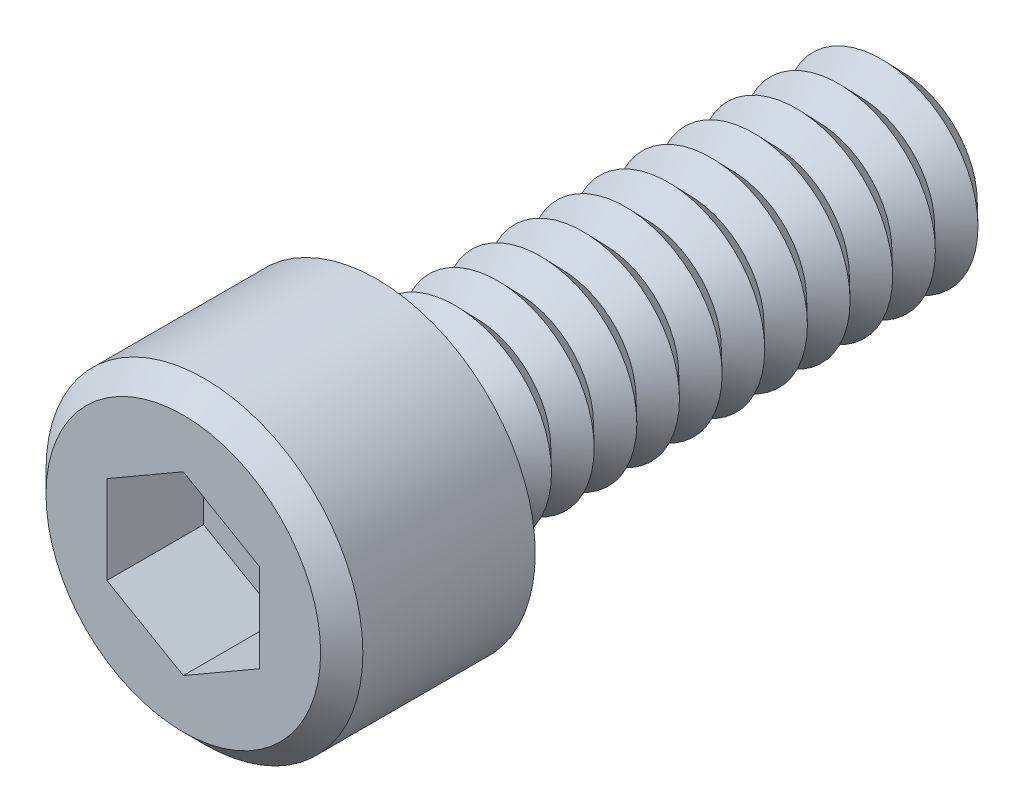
ISO-10303-21;
HEADER;
FILE_DESCRIPTION(('STEP AP214'),'2;1');
FILE_NAME('part.step','',(''),(''),'','','');
FILE_SCHEMA(('AUTOMOTIVE_DESIGN { 1 0 10303 214 1 1 1 1 }'));
ENDSEC;
DATA;
#1=APPLICATION_CONTEXT('core data for automotive mechanical design processes');
#2=APPLICATION_PROTOCOL_DEFINITION('international standard','automotive_design',2000,#1);
#3=PRODUCT_CONTEXT('',#1,'mechanical');
#4=PRODUCT('Part','Part','',(#3));
#5=PRODUCT_RELATED_PRODUCT_CATEGORY('part','',(#4));
#6=PRODUCT_DEFINITION_FORMATION('','',#4);
#7=PRODUCT_DEFINITION_CONTEXT('part definition',#1,'design');
#8=PRODUCT_DEFINITION('design','',#6,#7);
#9=PRODUCT_DEFINITION_SHAPE('','',#8);
#10=(LENGTH_UNIT() NAMED_UNIT(*) SI_UNIT(.MILLI.,.METRE.));
#11=(NAMED_UNIT(*) PLANE_ANGLE_UNIT() SI_UNIT($,.RADIAN.));
#12=(NAMED_UNIT(*) SI_UNIT($,.STERADIAN.) SOLID_ANGLE_UNIT());
#13=UNCERTAINTY_MEASURE_WITH_UNIT(LENGTH_MEASURE(1.E-05),#10,'distance_accuracy_value','');
#14=(GEOMETRIC_REPRESENTATION_CONTEXT(3) GLOBAL_UNCERTAINTY_ASSIGNED_CONTEXT((#13)) GLOBAL_UNIT_ASSIGNED_CONTEXT((#10,
#11,#12)) REPRESENTATION_CONTEXT('',''));
#15=CARTESIAN_POINT('',(0.,0.,0.));
#16=DIRECTION('',(0.,0.,1.));
#17=DIRECTION('',(1.,0.,0.));
#18=AXIS2_PLACEMENT_3D('',#15,#16,#17);
#19=CARTESIAN_POINT('',(0.,0.,6.56695833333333));
#20=DIRECTION('',(0.,0.,1.));
#21=DIRECTION('',(1.,0.,0.));
#22=AXIS2_PLACEMENT_3D('',#19,#20,#21);
#23=CONICAL_SURFACE('',#22,1.7526,0.802893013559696);
#24=CARTESIAN_POINT('',(0.,0.,6.18066666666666));
#25=DIRECTION('',(0.,0.,1.));
#26=DIRECTION('',(1.,0.,0.));
#27=AXIS2_PLACEMENT_3D('',#24,#25,#26);
#28=CIRCLE('',#27,1.35255);
#29=CARTESIAN_POINT('',(1.35255,0.,6.18066666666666));
#30=VERTEX_POINT('',#29);
#31=EDGE_CURVE('E294',#30,#30,#28,.T.);
#32=ORIENTED_EDGE('',*,*,#31,.T.);
#33=EDGE_LOOP('',(#32));
#34=FACE_BOUND('',#33,.T.);
#35=CARTESIAN_POINT('',(0.,0.,6.56695833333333));
#36=DIRECTION('',(0.,0.,1.));
#37=DIRECTION('',(1.,0.,0.));
#38=AXIS2_PLACEMENT_3D('',#35,#36,#37);
#39=CIRCLE('',#38,1.7526);
#40=CARTESIAN_POINT('',(1.7526,0.,6.56695833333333));
#41=VERTEX_POINT('',#40);
#42=EDGE_CURVE('E285',#41,#41,#39,.T.);
#43=ORIENTED_EDGE('',*,*,#42,.F.);
#44=EDGE_LOOP('',(#43));
#45=FACE_BOUND('',#44,.T.);
#46=ADVANCED_FACE('F36',(#34,#45),#23,.T.);
#47=CARTESIAN_POINT('',(0.,0.,5.794375));
#48=DIRECTION('',(0.,0.,-1.));
#49=DIRECTION('',(-1.,0.,0.));
#50=AXIS2_PLACEMENT_3D('',#47,#48,#49);
#51=CONICAL_SURFACE('',#50,1.7526,0.802893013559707);
#52=ORIENTED_EDGE('',*,*,#31,.F.);
#53=EDGE_LOOP('',(#52));
#54=FACE_BOUND('',#53,.T.);
#55=CARTESIAN_POINT('',(0.,0.,5.794375));
#56=DIRECTION('',(0.,0.,1.));
#57=DIRECTION('',(1.,0.,0.));
#58=AXIS2_PLACEMENT_3D('',#55,#56,#57);
#59=CIRCLE('',#58,1.7526);
#60=CARTESIAN_POINT('',(1.7526,0.,5.794375));
#61=VERTEX_POINT('',#60);
#62=EDGE_CURVE('E291',#61,#61,#59,.T.);
#63=ORIENTED_EDGE('',*,*,#62,.T.);
#64=EDGE_LOOP('',(#63));
#65=FACE_BOUND('',#64,.T.);
#66=ADVANCED_FACE('F169',(#54,#65),#51,.T.);
#67=CARTESIAN_POINT('',(0.,0.,0.));
#68=DIRECTION('',(0.,0.,1.));
#69=DIRECTION('',(1.,0.,0.));
#70=AXIS2_PLACEMENT_3D('',#67,#68,#69);
#71=PLANE('',#70);
#72=CARTESIAN_POINT('',(0.,0.,0.));
#73=DIRECTION('',(0.,0.,-1.));
#74=DIRECTION('',(-1.,0.,0.));
#75=AXIS2_PLACEMENT_3D('',#72,#73,#74);
#76=CIRCLE('',#75,1.35255);
#77=CARTESIAN_POINT('',(-1.35255,0.,0.));
#78=VERTEX_POINT('',#77);
#79=EDGE_CURVE('E125',#78,#78,#76,.T.);
#80=ORIENTED_EDGE('',*,*,#79,.T.);
#81=EDGE_LOOP('',(#80));
#82=FACE_BOUND('',#81,.T.);
#83=ADVANCED_FACE('F175',(#82),#71,.F.);
#84=CARTESIAN_POINT('',(0.,0.,0.386291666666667));
#85=DIRECTION('',(0.,0.,1.));
#86=DIRECTION('',(1.,0.,0.));
#87=AXIS2_PLACEMENT_3D('',#84,#85,#86);
#88=CONICAL_SURFACE('',#87,1.7526,0.802893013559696);
#89=ORIENTED_EDGE('',*,*,#79,.F.);
#90=EDGE_LOOP('',(#89));
#91=FACE_BOUND('',#90,.T.);
#92=CARTESIAN_POINT('',(0.,0.,0.386291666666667));
#93=DIRECTION('',(0.,0.,1.));
#94=DIRECTION('',(1.,0.,0.));
#95=AXIS2_PLACEMENT_3D('',#92,#93,#94);
#96=CIRCLE('',#95,1.7526);
#97=CARTESIAN_POINT('',(1.7526,0.,0.386291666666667));
#98=VERTEX_POINT('',#97);
#99=EDGE_CURVE('E335',#98,#98,#96,.T.);
#100=ORIENTED_EDGE('',*,*,#99,.F.);
#101=EDGE_LOOP('',(#100));
#102=FACE_BOUND('',#101,.T.);
#103=ADVANCED_FACE('F222',(#91,#102),#88,.T.);
#104=CARTESIAN_POINT('',(0.,0.,0.386291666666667));
#105=DIRECTION('',(0.,0.,-1.));
#106=DIRECTION('',(-1.,0.,0.));
#107=AXIS2_PLACEMENT_3D('',#104,#105,#106);
#108=CONICAL_SURFACE('',#107,1.7526,0.802893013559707);
#109=CARTESIAN_POINT('',(0.,0.,0.772583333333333));
#110=DIRECTION('',(0.,0.,-1.));
#111=DIRECTION('',(-1.,0.,0.));
#112=AXIS2_PLACEMENT_3D('',#109,#110,#111);
#113=CIRCLE('',#112,1.35255);
#114=CARTESIAN_POINT('',(-1.35255,0.,0.772583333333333));
#115=VERTEX_POINT('',#114);
#116=EDGE_CURVE('E332',#115,#115,#113,.T.);
#117=ORIENTED_EDGE('',*,*,#116,.T.);
#118=EDGE_LOOP('',(#117));
#119=FACE_BOUND('',#118,.T.);
#120=ORIENTED_EDGE('',*,*,#99,.T.);
#121=EDGE_LOOP('',(#120));
#122=FACE_BOUND('',#121,.T.);
#123=ADVANCED_FACE('F218',(#119,#122),#108,.T.);
#124=CARTESIAN_POINT('',(0.,0.,1.158875));
#125=DIRECTION('',(0.,0.,1.));
#126=DIRECTION('',(1.,0.,0.));
#127=AXIS2_PLACEMENT_3D('',#124,#125,#126);
#128=CONICAL_SURFACE('',#127,1.7526,0.802893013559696);
#129=ORIENTED_EDGE('',*,*,#116,.F.);
#130=EDGE_LOOP('',(#129));
#131=FACE_BOUND('',#130,.T.);
#132=CARTESIAN_POINT('',(0.,0.,1.158875));
#133=DIRECTION('',(0.,0.,1.));
#134=DIRECTION('',(1.,0.,0.));
#135=AXIS2_PLACEMENT_3D('',#132,#133,#134);
#136=CIRCLE('',#135,1.7526);
#137=CARTESIAN_POINT('',(1.7526,0.,1.158875));
#138=VERTEX_POINT('',#137);
#139=EDGE_CURVE('E326',#138,#138,#136,.T.);
#140=ORIENTED_EDGE('',*,*,#139,.F.);
#141=EDGE_LOOP('',(#140));
#142=FACE_BOUND('',#141,.T.);
#143=ADVANCED_FACE('F215',(#131,#142),#128,.T.);
#144=CARTESIAN_POINT('',(0.,0.,1.158875));
#145=DIRECTION('',(0.,0.,-1.));
#146=DIRECTION('',(-1.,0.,0.));
#147=AXIS2_PLACEMENT_3D('',#144,#145,#146);
#148=CONICAL_SURFACE('',#147,1.7526,0.802893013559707);
#149=CARTESIAN_POINT('',(0.,0.,1.54516666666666));
#150=DIRECTION('',(0.,0.,1.));
#151=DIRECTION('',(1.,0.,0.));
#152=AXIS2_PLACEMENT_3D('',#149,#150,#151);
#153=CIRCLE('',#152,1.35255);
#154=CARTESIAN_POINT('',(1.35255,0.,1.54516666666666));
#155=VERTEX_POINT('',#154);
#156=EDGE_CURVE('E329',#155,#155,#153,.T.);
#157=ORIENTED_EDGE('',*,*,#156,.F.);
#158=EDGE_LOOP('',(#157));
#159=FACE_BOUND('',#158,.T.);
#160=ORIENTED_EDGE('',*,*,#139,.T.);
#161=EDGE_LOOP('',(#160));
#162=FACE_BOUND('',#161,.T.);
#163=ADVANCED_FACE('F213',(#159,#162),#148,.T.);
#164=CARTESIAN_POINT('',(0.,0.,1.93145833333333));
#165=DIRECTION('',(0.,0.,1.));
#166=DIRECTION('',(1.,0.,0.));
#167=AXIS2_PLACEMENT_3D('',#164,#165,#166);
#168=CONICAL_SURFACE('',#167,1.7526,0.802893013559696);
#169=ORIENTED_EDGE('',*,*,#156,.T.);
#170=EDGE_LOOP('',(#169));
#171=FACE_BOUND('',#170,.T.);
#172=CARTESIAN_POINT('',(0.,0.,1.93145833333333));
#173=DIRECTION('',(0.,0.,1.));
#174=DIRECTION('',(1.,0.,0.));
#175=AXIS2_PLACEMENT_3D('',#172,#173,#174);
#176=CIRCLE('',#175,1.7526);
#177=CARTESIAN_POINT('',(1.7526,0.,1.93145833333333));
#178=VERTEX_POINT('',#177);
#179=EDGE_CURVE('E320',#178,#178,#176,.T.);
#180=ORIENTED_EDGE('',*,*,#179,.F.);
#181=EDGE_LOOP('',(#180));
#182=FACE_BOUND('',#181,.T.);
#183=ADVANCED_FACE('F210',(#171,#182),#168,.T.);
#184=CARTESIAN_POINT('',(0.,0.,1.93145833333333));
#185=DIRECTION('',(0.,0.,-1.));
#186=DIRECTION('',(-1.,0.,0.));
#187=AXIS2_PLACEMENT_3D('',#184,#185,#186);
#188=CONICAL_SURFACE('',#187,1.7526,0.802893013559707);
#189=CARTESIAN_POINT('',(0.,0.,2.31774999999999));
#190=DIRECTION('',(0.,0.,1.));
#191=DIRECTION('',(1.,0.,0.));
#192=AXIS2_PLACEMENT_3D('',#189,#190,#191);
#193=CIRCLE('',#192,1.35255);
#194=CARTESIAN_POINT('',(1.35255,0.,2.31774999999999));
#195=VERTEX_POINT('',#194);
#196=EDGE_CURVE('E323',#195,#195,#193,.T.);
#197=ORIENTED_EDGE('',*,*,#196,.F.);
#198=EDGE_LOOP('',(#197));
#199=FACE_BOUND('',#198,.T.);
#200=ORIENTED_EDGE('',*,*,#179,.T.);
#201=EDGE_LOOP('',(#200));
#202=FACE_BOUND('',#201,.T.);
#203=ADVANCED_FACE('F208',(#199,#202),#188,.T.);
#204=CARTESIAN_POINT('',(0.,0.,2.70404166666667));
#205=DIRECTION('',(0.,0.,1.));
#206=DIRECTION('',(1.,0.,0.));
#207=AXIS2_PLACEMENT_3D('',#204,#205,#206);
#208=CONICAL_SURFACE('',#207,1.7526,0.802893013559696);
#209=ORIENTED_EDGE('',*,*,#196,.T.);
#210=EDGE_LOOP('',(#209));
#211=FACE_BOUND('',#210,.T.);
#212=CARTESIAN_POINT('',(0.,0.,2.70404166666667));
#213=DIRECTION('',(0.,0.,1.));
#214=DIRECTION('',(1.,0.,0.));
#215=AXIS2_PLACEMENT_3D('',#212,#213,#214);
#216=CIRCLE('',#215,1.7526);
#217=CARTESIAN_POINT('',(1.7526,0.,2.70404166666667));
#218=VERTEX_POINT('',#217);
#219=EDGE_CURVE('E314',#218,#218,#216,.T.);
#220=ORIENTED_EDGE('',*,*,#219,.F.);
#221=EDGE_LOOP('',(#220));
#222=FACE_BOUND('',#221,.T.);
#223=ADVANCED_FACE('F205',(#211,#222),#208,.T.);
#224=CARTESIAN_POINT('',(0.,0.,2.70404166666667));
#225=DIRECTION('',(0.,0.,-1.));
#226=DIRECTION('',(-1.,0.,0.));
#227=AXIS2_PLACEMENT_3D('',#224,#225,#226);
#228=CONICAL_SURFACE('',#227,1.7526,0.802893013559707);
#229=CARTESIAN_POINT('',(0.,0.,3.09033333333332));
#230=DIRECTION('',(0.,0.,1.));
#231=DIRECTION('',(1.,0.,0.));
#232=AXIS2_PLACEMENT_3D('',#229,#230,#231);
#233=CIRCLE('',#232,1.35255);
#234=CARTESIAN_POINT('',(1.35255,0.,3.09033333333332));
#235=VERTEX_POINT('',#234);
#236=EDGE_CURVE('E317',#235,#235,#233,.T.);
#237=ORIENTED_EDGE('',*,*,#236,.F.);
#238=EDGE_LOOP('',(#237));
#239=FACE_BOUND('',#238,.T.);
#240=ORIENTED_EDGE('',*,*,#219,.T.);
#241=EDGE_LOOP('',(#240));
#242=FACE_BOUND('',#241,.T.);
#243=ADVANCED_FACE('F203',(#239,#242),#228,.T.);
#244=CARTESIAN_POINT('',(0.,0.,3.476625));
#245=DIRECTION('',(0.,0.,1.));
#246=DIRECTION('',(1.,0.,0.));
#247=AXIS2_PLACEMENT_3D('',#244,#245,#246);
#248=CONICAL_SURFACE('',#247,1.7526,0.802893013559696);
#249=ORIENTED_EDGE('',*,*,#236,.T.);
#250=EDGE_LOOP('',(#249));
#251=FACE_BOUND('',#250,.T.);
#252=CARTESIAN_POINT('',(0.,0.,3.476625));
#253=DIRECTION('',(0.,0.,1.));
#254=DIRECTION('',(1.,0.,0.));
#255=AXIS2_PLACEMENT_3D('',#252,#253,#254);
#256=CIRCLE('',#255,1.7526);
#257=CARTESIAN_POINT('',(1.7526,0.,3.476625));
#258=VERTEX_POINT('',#257);
#259=EDGE_CURVE('E308',#258,#258,#256,.T.);
#260=ORIENTED_EDGE('',*,*,#259,.F.);
#261=EDGE_LOOP('',(#260));
#262=FACE_BOUND('',#261,.T.);
#263=ADVANCED_FACE('F200',(#251,#262),#248,.T.);
#264=CARTESIAN_POINT('',(0.,0.,3.476625));
#265=DIRECTION('',(0.,0.,-1.));
#266=DIRECTION('',(-1.,0.,0.));
#267=AXIS2_PLACEMENT_3D('',#264,#265,#266);
#268=CONICAL_SURFACE('',#267,1.7526,0.802893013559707);
#269=CARTESIAN_POINT('',(0.,0.,3.86291666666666));
#270=DIRECTION('',(0.,0.,1.));
#271=DIRECTION('',(1.,0.,0.));
#272=AXIS2_PLACEMENT_3D('',#269,#270,#271);
#273=CIRCLE('',#272,1.35255);
#274=CARTESIAN_POINT('',(1.35255,0.,3.86291666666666));
#275=VERTEX_POINT('',#274);
#276=EDGE_CURVE('E311',#275,#275,#273,.T.);
#277=ORIENTED_EDGE('',*,*,#276,.F.);
#278=EDGE_LOOP('',(#277));
#279=FACE_BOUND('',#278,.T.);
#280=ORIENTED_EDGE('',*,*,#259,.T.);
#281=EDGE_LOOP('',(#280));
#282=FACE_BOUND('',#281,.T.);
#283=ADVANCED_FACE('F198',(#279,#282),#268,.T.);
#284=CARTESIAN_POINT('',(0.,0.,4.24920833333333));
#285=DIRECTION('',(0.,0.,1.));
#286=DIRECTION('',(1.,0.,0.));
#287=AXIS2_PLACEMENT_3D('',#284,#285,#286);
#288=CONICAL_SURFACE('',#287,1.7526,0.802893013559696);
#289=ORIENTED_EDGE('',*,*,#276,.T.);
#290=EDGE_LOOP('',(#289));
#291=FACE_BOUND('',#290,.T.);
#292=CARTESIAN_POINT('',(0.,0.,4.24920833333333));
#293=DIRECTION('',(0.,0.,1.));
#294=DIRECTION('',(1.,0.,0.));
#295=AXIS2_PLACEMENT_3D('',#292,#293,#294);
#296=CIRCLE('',#295,1.7526);
#297=CARTESIAN_POINT('',(1.7526,0.,4.24920833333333));
#298=VERTEX_POINT('',#297);
#299=EDGE_CURVE('E302',#298,#298,#296,.T.);
#300=ORIENTED_EDGE('',*,*,#299,.F.);
#301=EDGE_LOOP('',(#300));
#302=FACE_BOUND('',#301,.T.);
#303=ADVANCED_FACE('F195',(#291,#302),#288,.T.);
#304=CARTESIAN_POINT('',(0.,0.,4.24920833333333));
#305=DIRECTION('',(0.,0.,-1.));
#306=DIRECTION('',(-1.,0.,0.));
#307=AXIS2_PLACEMENT_3D('',#304,#305,#306);
#308=CONICAL_SURFACE('',#307,1.7526,0.802893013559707);
#309=CARTESIAN_POINT('',(0.,0.,4.63549999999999));
#310=DIRECTION('',(0.,0.,1.));
#311=DIRECTION('',(1.,0.,0.));
#312=AXIS2_PLACEMENT_3D('',#309,#310,#311);
#313=CIRCLE('',#312,1.35255);
#314=CARTESIAN_POINT('',(1.35255,0.,4.63549999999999));
#315=VERTEX_POINT('',#314);
#316=EDGE_CURVE('E305',#315,#315,#313,.T.);
#317=ORIENTED_EDGE('',*,*,#316,.F.);
#318=EDGE_LOOP('',(#317));
#319=FACE_BOUND('',#318,.T.);
#320=ORIENTED_EDGE('',*,*,#299,.T.);
#321=EDGE_LOOP('',(#320));
#322=FACE_BOUND('',#321,.T.);
#323=ADVANCED_FACE('F193',(#319,#322),#308,.T.);
#324=CARTESIAN_POINT('',(0.,0.,5.02179166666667));
#325=DIRECTION('',(0.,0.,1.));
#326=DIRECTION('',(1.,0.,0.));
#327=AXIS2_PLACEMENT_3D('',#324,#325,#326);
#328=CONICAL_SURFACE('',#327,1.7526,0.802893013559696);
#329=ORIENTED_EDGE('',*,*,#316,.T.);
#330=EDGE_LOOP('',(#329));
#331=FACE_BOUND('',#330,.T.);
#332=CARTESIAN_POINT('',(0.,0.,5.02179166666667));
#333=DIRECTION('',(0.,0.,1.));
#334=DIRECTION('',(1.,0.,0.));
#335=AXIS2_PLACEMENT_3D('',#332,#333,#334);
#336=CIRCLE('',#335,1.7526);
#337=CARTESIAN_POINT('',(1.7526,0.,5.02179166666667));
#338=VERTEX_POINT('',#337);
#339=EDGE_CURVE('E296',#338,#338,#336,.T.);
#340=ORIENTED_EDGE('',*,*,#339,.F.);
#341=EDGE_LOOP('',(#340));
#342=FACE_BOUND('',#341,.T.);
#343=ADVANCED_FACE('F190',(#331,#342),#328,.T.);
#344=CARTESIAN_POINT('',(0.,0.,5.02179166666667));
#345=DIRECTION('',(0.,0.,-1.));
#346=DIRECTION('',(-1.,0.,0.));
#347=AXIS2_PLACEMENT_3D('',#344,#345,#346);
#348=CONICAL_SURFACE('',#347,1.7526,0.802893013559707);
#349=CARTESIAN_POINT('',(0.,0.,5.40808333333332));
#350=DIRECTION('',(0.,0.,1.));
#351=DIRECTION('',(1.,0.,0.));
#352=AXIS2_PLACEMENT_3D('',#349,#350,#351);
#353=CIRCLE('',#352,1.35255);
#354=CARTESIAN_POINT('',(1.35255,0.,5.40808333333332));
#355=VERTEX_POINT('',#354);
#356=EDGE_CURVE('E299',#355,#355,#353,.T.);
#357=ORIENTED_EDGE('',*,*,#356,.F.);
#358=EDGE_LOOP('',(#357));
#359=FACE_BOUND('',#358,.T.);
#360=ORIENTED_EDGE('',*,*,#339,.T.);
#361=EDGE_LOOP('',(#360));
#362=FACE_BOUND('',#361,.T.);
#363=ADVANCED_FACE('F188',(#359,#362),#348,.T.);
#364=CARTESIAN_POINT('',(0.,0.,5.794375));
#365=DIRECTION('',(0.,0.,1.));
#366=DIRECTION('',(1.,0.,0.));
#367=AXIS2_PLACEMENT_3D('',#364,#365,#366);
#368=CONICAL_SURFACE('',#367,1.7526,0.802893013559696);
#369=ORIENTED_EDGE('',*,*,#356,.T.);
#370=EDGE_LOOP('',(#369));
#371=FACE_BOUND('',#370,.T.);
#372=ORIENTED_EDGE('',*,*,#62,.F.);
#373=EDGE_LOOP('',(#372));
#374=FACE_BOUND('',#373,.T.);
#375=ADVANCED_FACE('F184',(#371,#374),#368,.T.);
#376=CARTESIAN_POINT('',(0.,0.,6.56695833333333));
#377=DIRECTION('',(0.,0.,-1.));
#378=DIRECTION('',(-1.,0.,0.));
#379=AXIS2_PLACEMENT_3D('',#376,#377,#378);
#380=CONICAL_SURFACE('',#379,1.7526,0.802893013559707);
#381=CARTESIAN_POINT('',(0.,0.,6.95324999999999));
#382=DIRECTION('',(0.,0.,1.));
#383=DIRECTION('',(1.,0.,0.));
#384=AXIS2_PLACEMENT_3D('',#381,#382,#383);
#385=CIRCLE('',#384,1.35255);
#386=CARTESIAN_POINT('',(1.35255,0.,6.95324999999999));
#387=VERTEX_POINT('',#386);
#388=EDGE_CURVE('E288',#387,#387,#385,.T.);
#389=ORIENTED_EDGE('',*,*,#388,.F.);
#390=EDGE_LOOP('',(#389));
#391=FACE_BOUND('',#390,.T.);
#392=ORIENTED_EDGE('',*,*,#42,.T.);
#393=EDGE_LOOP('',(#392));
#394=FACE_BOUND('',#393,.T.);
#395=ADVANCED_FACE('F187',(#391,#394),#380,.T.);
#396=CARTESIAN_POINT('',(0.,0.,7.33954166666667));
#397=DIRECTION('',(0.,0.,1.));
#398=DIRECTION('',(1.,0.,0.));
#399=AXIS2_PLACEMENT_3D('',#396,#397,#398);
#400=CONICAL_SURFACE('',#399,1.7526,0.802893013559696);
#401=ORIENTED_EDGE('',*,*,#388,.T.);
#402=EDGE_LOOP('',(#401));
#403=FACE_BOUND('',#402,.T.);
#404=CARTESIAN_POINT('',(0.,0.,7.33954166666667));
#405=DIRECTION('',(0.,0.,1.));
#406=DIRECTION('',(1.,0.,0.));
#407=AXIS2_PLACEMENT_3D('',#404,#405,#406);
#408=CIRCLE('',#407,1.7526);
#409=CARTESIAN_POINT('',(1.7526,0.,7.33954166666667));
#410=VERTEX_POINT('',#409);
#411=EDGE_CURVE('E279',#410,#410,#408,.T.);
#412=ORIENTED_EDGE('',*,*,#411,.F.);
#413=EDGE_LOOP('',(#412));
#414=FACE_BOUND('',#413,.T.);
#415=ADVANCED_FACE('F182',(#403,#414),#400,.T.);
#416=CARTESIAN_POINT('',(0.,0.,7.33954166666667));
#417=DIRECTION('',(0.,0.,-1.));
#418=DIRECTION('',(-1.,0.,0.));
#419=AXIS2_PLACEMENT_3D('',#416,#417,#418);
#420=CONICAL_SURFACE('',#419,1.7526,0.802893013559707);
#421=CARTESIAN_POINT('',(0.,0.,7.72583333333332));
#422=DIRECTION('',(0.,0.,1.));
#423=DIRECTION('',(1.,0.,0.));
#424=AXIS2_PLACEMENT_3D('',#421,#422,#423);
#425=CIRCLE('',#424,1.35255);
#426=CARTESIAN_POINT('',(1.35255,0.,7.72583333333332));
#427=VERTEX_POINT('',#426);
#428=EDGE_CURVE('E282',#427,#427,#425,.T.);
#429=ORIENTED_EDGE('',*,*,#428,.F.);
#430=EDGE_LOOP('',(#429));
#431=FACE_BOUND('',#430,.T.);
#432=ORIENTED_EDGE('',*,*,#411,.T.);
#433=EDGE_LOOP('',(#432));
#434=FACE_BOUND('',#433,.T.);
#435=ADVANCED_FACE('F367',(#431,#434),#420,.T.);
#436=CARTESIAN_POINT('',(0.,0.,8.112125));
#437=DIRECTION('',(0.,0.,1.));
#438=DIRECTION('',(1.,0.,0.));
#439=AXIS2_PLACEMENT_3D('',#436,#437,#438);
#440=CONICAL_SURFACE('',#439,1.7526,0.802893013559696);
#441=ORIENTED_EDGE('',*,*,#428,.T.);
#442=EDGE_LOOP('',(#441));
#443=FACE_BOUND('',#442,.T.);
#444=CARTESIAN_POINT('',(0.,0.,8.112125));
#445=DIRECTION('',(0.,0.,1.));
#446=DIRECTION('',(1.,0.,0.));
#447=AXIS2_PLACEMENT_3D('',#444,#445,#446);
#448=CIRCLE('',#447,1.7526);
#449=CARTESIAN_POINT('',(1.7526,0.,8.112125));
#450=VERTEX_POINT('',#449);
#451=EDGE_CURVE('E266',#450,#450,#448,.T.);
#452=ORIENTED_EDGE('',*,*,#451,.F.);
#453=EDGE_LOOP('',(#452));
#454=FACE_BOUND('',#453,.T.);
#455=ADVANCED_FACE('F365',(#443,#454),#440,.T.);
#456=CARTESIAN_POINT('',(0.,0.,8.112125));
#457=DIRECTION('',(0.,0.,-1.));
#458=DIRECTION('',(-1.,0.,0.));
#459=AXIS2_PLACEMENT_3D('',#456,#457,#458);
#460=CONICAL_SURFACE('',#459,1.7526,0.802893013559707);
#461=CARTESIAN_POINT('',(0.,0.,8.49841666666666));
#462=DIRECTION('',(0.,0.,1.));
#463=DIRECTION('',(1.,0.,0.));
#464=AXIS2_PLACEMENT_3D('',#461,#462,#463);
#465=CIRCLE('',#464,1.35255);
#466=CARTESIAN_POINT('',(1.35255,0.,8.49841666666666));
#467=VERTEX_POINT('',#466);
#468=EDGE_CURVE('E270',#467,#467,#465,.T.);
#469=ORIENTED_EDGE('',*,*,#468,.F.);
#470=EDGE_LOOP('',(#469));
#471=FACE_BOUND('',#470,.T.);
#472=ORIENTED_EDGE('',*,*,#451,.T.);
#473=EDGE_LOOP('',(#472));
#474=FACE_BOUND('',#473,.T.);
#475=ADVANCED_FACE('F363',(#471,#474),#460,.T.);
#476=CARTESIAN_POINT('',(0.,0.,8.88470833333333));
#477=DIRECTION('',(0.,0.,1.));
#478=DIRECTION('',(1.,0.,0.));
#479=AXIS2_PLACEMENT_3D('',#476,#477,#478);
#480=CONICAL_SURFACE('',#479,1.7526,0.802893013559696);
#481=ORIENTED_EDGE('',*,*,#468,.T.);
#482=EDGE_LOOP('',(#481));
#483=FACE_BOUND('',#482,.T.);
#484=CARTESIAN_POINT('',(0.,0.,8.88470833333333));
#485=DIRECTION('',(0.,0.,1.));
#486=DIRECTION('',(1.,0.,0.));
#487=AXIS2_PLACEMENT_3D('',#484,#485,#486);
#488=CIRCLE('',#487,1.7526);
#489=CARTESIAN_POINT('',(1.7526,0.,8.88470833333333));
#490=VERTEX_POINT('',#489);
#491=EDGE_CURVE('E273',#490,#490,#488,.T.);
#492=ORIENTED_EDGE('',*,*,#491,.F.);
#493=EDGE_LOOP('',(#492));
#494=FACE_BOUND('',#493,.T.);
#495=ADVANCED_FACE('F360',(#483,#494),#480,.T.);
#496=CARTESIAN_POINT('',(0.,1.35255,9.27099999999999));
#497=DIRECTION('',(0.,0.,1.));
#498=DIRECTION('',(1.,0.,0.));
#499=AXIS2_PLACEMENT_3D('',#496,#497,#498);
#500=PLANE('',#499);
#501=CARTESIAN_POINT('',(0.,0.,9.27099999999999));
#502=DIRECTION('',(0.,0.,1.));
#503=DIRECTION('',(1.,0.,0.));
#504=AXIS2_PLACEMENT_3D('',#501,#502,#503);
#505=CIRCLE('',#504,1.7526);
#506=CARTESIAN_POINT('',(1.7526,0.,9.27099999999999));
#507=VERTEX_POINT('',#506);
#508=EDGE_CURVE('E260',#507,#507,#505,.T.);
#509=ORIENTED_EDGE('',*,*,#508,.F.);
#510=EDGE_LOOP('',(#509));
#511=FACE_BOUND('',#510,.T.);
#512=CARTESIAN_POINT('',(0.,0.,9.27099999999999));
#513=DIRECTION('',(0.,0.,1.));
#514=DIRECTION('',(1.,0.,0.));
#515=AXIS2_PLACEMENT_3D('',#512,#513,#514);
#516=CIRCLE('',#515,1.35255);
#517=CARTESIAN_POINT('',(1.35255,0.,9.27099999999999));
#518=VERTEX_POINT('',#517);
#519=EDGE_CURVE('E267',#518,#518,#516,.T.);
#520=ORIENTED_EDGE('',*,*,#519,.T.);
#521=EDGE_LOOP('',(#520));
#522=FACE_BOUND('',#521,.T.);
#523=ADVANCED_FACE('F362',(#511,#522),#500,.F.);
#524=CARTESIAN_POINT('',(0.,0.,8.88470833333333));
#525=DIRECTION('',(0.,0.,-1.));
#526=DIRECTION('',(-1.,0.,0.));
#527=AXIS2_PLACEMENT_3D('',#524,#525,#526);
#528=CONICAL_SURFACE('',#527,1.7526,0.802893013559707);
#529=ORIENTED_EDGE('',*,*,#519,.F.);
#530=EDGE_LOOP('',(#529));
#531=FACE_BOUND('',#530,.T.);
#532=ORIENTED_EDGE('',*,*,#491,.T.);
#533=EDGE_LOOP('',(#532));
#534=FACE_BOUND('',#533,.T.);
#535=ADVANCED_FACE('F230',(#531,#534),#528,.T.);
#536=CARTESIAN_POINT('',(-2.7686,0.,11.2776000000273));
#537=DIRECTION('',(0.,0.,-1.));
#538=DIRECTION('',(-1.,0.,0.));
#539=AXIS2_PLACEMENT_3D('',#536,#537,#538);
#540=PLANE('',#539);
#541=DIRECTION('',(-0.866025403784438,-0.5,0.));
#542=VECTOR('',#541,1.);
#543=CARTESIAN_POINT('',(0.,1.5984519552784,11.2776000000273));
#544=LINE('',#543,#542);
#545=CARTESIAN_POINT('',(0.,1.5984519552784,11.2776000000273));
#546=VERTEX_POINT('',#545);
#547=CARTESIAN_POINT('',(-1.3843,0.799225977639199,11.2776000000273));
#548=VERTEX_POINT('',#547);
#549=EDGE_CURVE('E137',#546,#548,#544,.T.);
#550=ORIENTED_EDGE('',*,*,#549,.T.);
#551=DIRECTION('',(0.,-1.,0.));
#552=VECTOR('',#551,1.);
#553=CARTESIAN_POINT('',(-1.3843,0.799225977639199,11.2776000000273));
#554=LINE('',#553,#552);
#555=CARTESIAN_POINT('',(-1.3843,-0.799225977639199,11.2776000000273));
#556=VERTEX_POINT('',#555);
#557=EDGE_CURVE('E118',#548,#556,#554,.T.);
#558=ORIENTED_EDGE('',*,*,#557,.T.);
#559=DIRECTION('',(-0.866025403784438,0.500000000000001,0.));
#560=VECTOR('',#559,1.);
#561=CARTESIAN_POINT('',(0.,-1.5984519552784,11.2776000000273));
#562=LINE('',#561,#560);
#563=CARTESIAN_POINT('',(0.,-1.5984519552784,11.2776000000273));
#564=VERTEX_POINT('',#563);
#565=EDGE_CURVE('E116',#564,#556,#562,.T.);
#566=ORIENTED_EDGE('',*,*,#565,.F.);
#567=DIRECTION('',(0.866025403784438,0.500000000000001,0.));
#568=VECTOR('',#567,1.);
#569=CARTESIAN_POINT('',(0.,-1.5984519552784,11.2776000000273));
#570=LINE('',#569,#568);
#571=CARTESIAN_POINT('',(1.3843,-0.799225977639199,11.2776000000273));
#572=VERTEX_POINT('',#571);
#573=EDGE_CURVE('E102',#564,#572,#570,.T.);
#574=ORIENTED_EDGE('',*,*,#573,.T.);
#575=DIRECTION('',(0.,-1.,0.));
#576=VECTOR('',#575,1.);
#577=CARTESIAN_POINT('',(1.3843,0.799225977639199,11.2776000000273));
#578=LINE('',#577,#576);
#579=CARTESIAN_POINT('',(1.3843,0.799225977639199,11.2776000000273));
#580=VERTEX_POINT('',#579);
#581=EDGE_CURVE('E92',#580,#572,#578,.T.);
#582=ORIENTED_EDGE('',*,*,#581,.F.);
#583=DIRECTION('',(0.866025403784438,-0.5,0.));
#584=VECTOR('',#583,1.);
#585=CARTESIAN_POINT('',(0.,1.5984519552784,11.2776000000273));
#586=LINE('',#585,#584);
#587=EDGE_CURVE('E101',#546,#580,#586,.T.);
#588=ORIENTED_EDGE('',*,*,#587,.F.);
#589=EDGE_LOOP('',(#550,#558,#566,#574,#582,#588));
#590=FACE_BOUND('',#589,.T.);
#591=ADVANCED_FACE('F114',(#590),#540,.F.);
#592=CARTESIAN_POINT('',(-1.3843,0.799225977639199,11.2776000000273));
#593=DIRECTION('',(-1.,0.,0.));
#594=DIRECTION('',(0.,0.,1.));
#595=AXIS2_PLACEMENT_3D('',#592,#593,#594);
#596=PLANE('',#595);
#597=DIRECTION('',(0.,-1.,0.));
#598=VECTOR('',#597,1.);
#599=CARTESIAN_POINT('',(-1.3843,0.799225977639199,13.0302000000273));
#600=LINE('',#599,#598);
#601=CARTESIAN_POINT('',(-1.3843,0.799225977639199,13.0302));
#602=VERTEX_POINT('',#601);
#603=CARTESIAN_POINT('',(-1.3843,-0.799225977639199,13.0302000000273));
#604=VERTEX_POINT('',#603);
#605=EDGE_CURVE('E124',#602,#604,#600,.T.);
#606=ORIENTED_EDGE('',*,*,#605,.T.);
#607=DIRECTION('',(0.,0.,1.));
#608=VECTOR('',#607,1.);
#609=CARTESIAN_POINT('',(-1.3843,-0.799225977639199,11.2776000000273));
#610=LINE('',#609,#608);
#611=EDGE_CURVE('E142',#556,#604,#610,.T.);
#612=ORIENTED_EDGE('',*,*,#611,.F.);
#613=ORIENTED_EDGE('',*,*,#557,.F.);
#614=DIRECTION('',(0.,0.,1.));
#615=VECTOR('',#614,1.);
#616=CARTESIAN_POINT('',(-1.3843,0.799225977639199,11.2776000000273));
#617=LINE('',#616,#615);
#618=EDGE_CURVE('E81',#548,#602,#617,.T.);
#619=ORIENTED_EDGE('',*,*,#618,.T.);
#620=EDGE_LOOP('',(#606,#612,#613,#619));
#621=FACE_BOUND('',#620,.T.);
#622=ADVANCED_FACE('F229',(#621),#596,.F.);
#623=CARTESIAN_POINT('',(0.,-1.5984519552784,11.2776000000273));
#624=DIRECTION('',(0.500000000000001,0.866025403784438,0.));
#625=DIRECTION('',(-0.866025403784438,0.500000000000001,0.));
#626=AXIS2_PLACEMENT_3D('',#623,#624,#625);
#627=PLANE('',#626);
#628=DIRECTION('',(-0.866025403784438,0.500000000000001,0.));
#629=VECTOR('',#628,1.);
#630=CARTESIAN_POINT('',(0.,-1.5984519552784,13.0302000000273));
#631=LINE('',#630,#629);
#632=CARTESIAN_POINT('',(0.,-1.5984519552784,13.0302000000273));
#633=VERTEX_POINT('',#632);
#634=EDGE_CURVE('E128',#633,#604,#631,.T.);
#635=ORIENTED_EDGE('',*,*,#634,.F.);
#636=DIRECTION('',(0.,0.,1.));
#637=VECTOR('',#636,1.);
#638=CARTESIAN_POINT('',(0.,-1.5984519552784,11.2776000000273));
#639=LINE('',#638,#637);
#640=EDGE_CURVE('E110',#564,#633,#639,.T.);
#641=ORIENTED_EDGE('',*,*,#640,.F.);
#642=ORIENTED_EDGE('',*,*,#565,.T.);
#643=ORIENTED_EDGE('',*,*,#611,.T.);
#644=EDGE_LOOP('',(#635,#641,#642,#643));
#645=FACE_BOUND('',#644,.T.);
#646=ADVANCED_FACE('F238',(#645),#627,.T.);
#647=CARTESIAN_POINT('',(0.,-1.5984519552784,11.2776000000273));
#648=DIRECTION('',(0.500000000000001,-0.866025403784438,0.));
#649=DIRECTION('',(0.866025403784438,0.500000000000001,0.));
#650=AXIS2_PLACEMENT_3D('',#647,#648,#649);
#651=PLANE('',#650);
#652=DIRECTION('',(0.866025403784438,0.500000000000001,0.));
#653=VECTOR('',#652,1.);
#654=CARTESIAN_POINT('',(0.,-1.5984519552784,13.0302000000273));
#655=LINE('',#654,#653);
#656=CARTESIAN_POINT('',(1.3843,-0.799225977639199,13.0302000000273));
#657=VERTEX_POINT('',#656);
#658=EDGE_CURVE('E108',#633,#657,#655,.T.);
#659=ORIENTED_EDGE('',*,*,#658,.T.);
#660=DIRECTION('',(0.,0.,1.));
#661=VECTOR('',#660,1.);
#662=CARTESIAN_POINT('',(1.3843,-0.799225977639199,11.2776000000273));
#663=LINE('',#662,#661);
#664=EDGE_CURVE('E96',#572,#657,#663,.T.);
#665=ORIENTED_EDGE('',*,*,#664,.F.);
#666=ORIENTED_EDGE('',*,*,#573,.F.);
#667=ORIENTED_EDGE('',*,*,#640,.T.);
#668=EDGE_LOOP('',(#659,#665,#666,#667));
#669=FACE_BOUND('',#668,.T.);
#670=ADVANCED_FACE('F106',(#669),#651,.F.);
#671=CARTESIAN_POINT('',(1.3843,0.799225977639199,11.2776000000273));
#672=DIRECTION('',(-1.,0.,0.));
#673=DIRECTION('',(0.,0.,1.));
#674=AXIS2_PLACEMENT_3D('',#671,#672,#673);
#675=PLANE('',#674);
#676=DIRECTION('',(0.,-1.,0.));
#677=VECTOR('',#676,1.);
#678=CARTESIAN_POINT('',(1.3843,0.799225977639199,13.0302000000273));
#679=LINE('',#678,#677);
#680=CARTESIAN_POINT('',(1.3843,0.799225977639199,13.0302000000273));
#681=VERTEX_POINT('',#680);
#682=EDGE_CURVE('E132',#681,#657,#679,.T.);
#683=ORIENTED_EDGE('',*,*,#682,.F.);
#684=DIRECTION('',(0.,0.,1.));
#685=VECTOR('',#684,1.);
#686=CARTESIAN_POINT('',(1.3843,0.799225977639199,11.2776000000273));
#687=LINE('',#686,#685);
#688=EDGE_CURVE('E98',#580,#681,#687,.T.);
#689=ORIENTED_EDGE('',*,*,#688,.F.);
#690=ORIENTED_EDGE('',*,*,#581,.T.);
#691=ORIENTED_EDGE('',*,*,#664,.T.);
#692=EDGE_LOOP('',(#683,#689,#690,#691));
#693=FACE_BOUND('',#692,.T.);
#694=ADVANCED_FACE('F95',(#693),#675,.T.);
#695=CARTESIAN_POINT('',(0.,1.5984519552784,11.2776000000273));
#696=DIRECTION('',(-0.5,-0.866025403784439,0.));
#697=DIRECTION('',(0.866025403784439,-0.5,0.));
#698=AXIS2_PLACEMENT_3D('',#695,#696,#697);
#699=PLANE('',#698);
#700=DIRECTION('',(0.866025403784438,-0.5,0.));
#701=VECTOR('',#700,1.);
#702=CARTESIAN_POINT('',(0.,1.5984519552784,13.0302000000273));
#703=LINE('',#702,#701);
#704=CARTESIAN_POINT('',(0.,1.5984519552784,13.0302000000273));
#705=VERTEX_POINT('',#704);
#706=EDGE_CURVE('E134',#705,#681,#703,.T.);
#707=ORIENTED_EDGE('',*,*,#706,.F.);
#708=DIRECTION('',(0.,0.,1.));
#709=VECTOR('',#708,1.);
#710=CARTESIAN_POINT('',(0.,1.5984519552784,11.2776000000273));
#711=LINE('',#710,#709);
#712=EDGE_CURVE('E59',#546,#705,#711,.T.);
#713=ORIENTED_EDGE('',*,*,#712,.F.);
#714=ORIENTED_EDGE('',*,*,#587,.T.);
#715=ORIENTED_EDGE('',*,*,#688,.T.);
#716=EDGE_LOOP('',(#707,#713,#714,#715));
#717=FACE_BOUND('',#716,.T.);
#718=ADVANCED_FACE('F231',(#717),#699,.T.);
#719=CARTESIAN_POINT('',(0.,1.5984519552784,11.2776000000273));
#720=DIRECTION('',(-0.5,0.866025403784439,0.));
#721=DIRECTION('',(-0.866025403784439,-0.5,0.));
#722=AXIS2_PLACEMENT_3D('',#719,#720,#721);
#723=PLANE('',#722);
#724=DIRECTION('',(-0.866025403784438,-0.5,0.));
#725=VECTOR('',#724,1.);
#726=CARTESIAN_POINT('',(0.,1.5984519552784,13.0302000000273));
#727=LINE('',#726,#725);
#728=EDGE_CURVE('E51',#705,#602,#727,.T.);
#729=ORIENTED_EDGE('',*,*,#728,.T.);
#730=ORIENTED_EDGE('',*,*,#618,.F.);
#731=ORIENTED_EDGE('',*,*,#549,.F.);
#732=ORIENTED_EDGE('',*,*,#712,.T.);
#733=EDGE_LOOP('',(#729,#730,#731,#732));
#734=FACE_BOUND('',#733,.T.);
#735=ADVANCED_FACE('F165',(#734),#723,.F.);
#736=CARTESIAN_POINT('',(0.,0.,13.0302));
#737=DIRECTION('',(0.,0.,1.));
#738=DIRECTION('',(1.,0.,0.));
#739=AXIS2_PLACEMENT_3D('',#736,#737,#738);
#740=PLANE('',#739);
#741=CARTESIAN_POINT('',(0.,0.,13.0302));
#742=DIRECTION('',(0.,0.,1.));
#743=DIRECTION('',(1.,0.,0.));
#744=AXIS2_PLACEMENT_3D('',#741,#742,#743);
#745=CIRCLE('',#744,2.48750666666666);
#746=CARTESIAN_POINT('',(-2.48750666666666,0.,13.0302));
#747=VERTEX_POINT('',#746);
#748=EDGE_CURVE('E44',#747,#747,#745,.T.);
#749=ORIENTED_EDGE('',*,*,#748,.T.);
#750=EDGE_LOOP('',(#749));
#751=FACE_BOUND('',#750,.T.);
#752=ORIENTED_EDGE('',*,*,#728,.F.);
#753=ORIENTED_EDGE('',*,*,#706,.T.);
#754=ORIENTED_EDGE('',*,*,#682,.T.);
#755=ORIENTED_EDGE('',*,*,#658,.F.);
#756=ORIENTED_EDGE('',*,*,#634,.T.);
#757=ORIENTED_EDGE('',*,*,#605,.F.);
#758=EDGE_LOOP('',(#752,#753,#754,#755,#756,#757));
#759=FACE_BOUND('',#758,.T.);
#760=ADVANCED_FACE('F152',(#751,#759),#740,.T.);
#761=CARTESIAN_POINT('',(0.,0.,13.0302));
#762=DIRECTION('',(0.,0.,-1.));
#763=DIRECTION('',(-1.,0.,0.));
#764=AXIS2_PLACEMENT_3D('',#761,#762,#763);
#765=CONICAL_SURFACE('',#764,2.48750666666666,0.785398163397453);
#766=CARTESIAN_POINT('',(0.,0.,12.6475066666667));
#767=DIRECTION('',(0.,0.,1.));
#768=DIRECTION('',(1.,0.,0.));
#769=AXIS2_PLACEMENT_3D('',#766,#767,#768);
#770=CIRCLE('',#769,2.8702);
#771=CARTESIAN_POINT('',(-2.8702,0.,12.6475066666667));
#772=VERTEX_POINT('',#771);
#773=EDGE_CURVE('E11',#772,#772,#770,.F.);
#774=CARTESIAN_POINT('',(-2.8702,0.,12.6475066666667));
#775=CARTESIAN_POINT('',(-2.86621361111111,0.,12.6514930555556));
#776=CARTESIAN_POINT('',(-2.86222722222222,0.,12.6554794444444));
#777=CARTESIAN_POINT('',(-2.85425444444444,0.,12.6634522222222));
#778=CARTESIAN_POINT('',(-2.85026805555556,0.,12.6674386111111));
#779=CARTESIAN_POINT('',(-2.84229527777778,0.,12.6754113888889));
#780=CARTESIAN_POINT('',(-2.83830888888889,0.,12.6793977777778));
#781=CARTESIAN_POINT('',(-2.83033611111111,0.,12.6873705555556));
#782=CARTESIAN_POINT('',(-2.82634972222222,0.,12.6913569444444));
#783=CARTESIAN_POINT('',(-2.81837694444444,0.,12.6993297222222));
#784=CARTESIAN_POINT('',(-2.81439055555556,0.,12.7033161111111));
#785=CARTESIAN_POINT('',(-2.80641777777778,0.,12.7112888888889));
#786=CARTESIAN_POINT('',(-2.80243138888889,0.,12.7152752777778));
#787=CARTESIAN_POINT('',(-2.79445861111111,0.,12.7232480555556));
#788=CARTESIAN_POINT('',(-2.79047222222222,0.,12.7272344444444));
#789=CARTESIAN_POINT('',(-2.78249944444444,0.,12.7352072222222));
#790=CARTESIAN_POINT('',(-2.77851305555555,0.,12.7391936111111));
#791=CARTESIAN_POINT('',(-2.77054027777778,0.,12.7471663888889));
#792=CARTESIAN_POINT('',(-2.76655388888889,0.,12.7511527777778));
#793=CARTESIAN_POINT('',(-2.75858111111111,0.,12.7591255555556));
#794=CARTESIAN_POINT('',(-2.75459472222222,0.,12.7631119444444));
#795=CARTESIAN_POINT('',(-2.74662194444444,0.,12.7710847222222));
#796=CARTESIAN_POINT('',(-2.74263555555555,0.,12.7750711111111));
#797=CARTESIAN_POINT('',(-2.73466277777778,0.,12.7830438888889));
#798=CARTESIAN_POINT('',(-2.73067638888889,0.,12.7870302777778));
#799=CARTESIAN_POINT('',(-2.72270361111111,0.,12.7950030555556));
#800=CARTESIAN_POINT('',(-2.71871722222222,0.,12.7989894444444));
#801=CARTESIAN_POINT('',(-2.71074444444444,0.,12.8069622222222));
#802=CARTESIAN_POINT('',(-2.70675805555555,0.,12.8109486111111));
#803=CARTESIAN_POINT('',(-2.69878527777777,0.,12.8189213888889));
#804=CARTESIAN_POINT('',(-2.69479888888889,0.,12.8229077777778));
#805=CARTESIAN_POINT('',(-2.68682611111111,0.,12.8308805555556));
#806=CARTESIAN_POINT('',(-2.68283972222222,0.,12.8348669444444));
#807=CARTESIAN_POINT('',(-2.67486694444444,0.,12.8428397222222));
#808=CARTESIAN_POINT('',(-2.67088055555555,0.,12.8468261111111));
#809=CARTESIAN_POINT('',(-2.66290777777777,0.,12.8547988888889));
#810=CARTESIAN_POINT('',(-2.65892138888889,0.,12.8587852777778));
#811=CARTESIAN_POINT('',(-2.65094861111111,0.,12.8667580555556));
#812=CARTESIAN_POINT('',(-2.64696222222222,0.,12.8707444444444));
#813=CARTESIAN_POINT('',(-2.63898944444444,0.,12.8787172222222));
#814=CARTESIAN_POINT('',(-2.63500305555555,0.,12.8827036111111));
#815=CARTESIAN_POINT('',(-2.62703027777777,0.,12.8906763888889));
#816=CARTESIAN_POINT('',(-2.62304388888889,0.,12.8946627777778));
#817=CARTESIAN_POINT('',(-2.61507111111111,0.,12.9026355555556));
#818=CARTESIAN_POINT('',(-2.61108472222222,0.,12.9066219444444));
#819=CARTESIAN_POINT('',(-2.60311194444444,0.,12.9145947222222));
#820=CARTESIAN_POINT('',(-2.59912555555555,0.,12.9185811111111));
#821=CARTESIAN_POINT('',(-2.59115277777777,0.,12.9265538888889));
#822=CARTESIAN_POINT('',(-2.58716638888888,0.,12.9305402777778));
#823=CARTESIAN_POINT('',(-2.57919361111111,0.,12.9385130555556));
#824=CARTESIAN_POINT('',(-2.57520722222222,0.,12.9424994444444));
#825=CARTESIAN_POINT('',(-2.56723444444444,0.,12.9504722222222));
#826=CARTESIAN_POINT('',(-2.56324805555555,0.,12.9544586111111));
#827=CARTESIAN_POINT('',(-2.55527527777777,0.,12.9624313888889));
#828=CARTESIAN_POINT('',(-2.55128888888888,0.,12.9664177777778));
#829=CARTESIAN_POINT('',(-2.54331611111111,0.,12.9743905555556));
#830=CARTESIAN_POINT('',(-2.53932972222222,0.,12.9783769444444));
#831=CARTESIAN_POINT('',(-2.53135694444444,0.,12.9863497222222));
#832=CARTESIAN_POINT('',(-2.52737055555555,0.,12.9903361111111));
#833=CARTESIAN_POINT('',(-2.51939777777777,0.,12.9983088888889));
#834=CARTESIAN_POINT('',(-2.51541138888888,0.,13.0022952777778));
#835=CARTESIAN_POINT('',(-2.50743861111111,0.,13.0102680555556));
#836=CARTESIAN_POINT('',(-2.50345222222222,0.,13.0142544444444));
#837=CARTESIAN_POINT('',(-2.49547944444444,0.,13.0222272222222));
#838=CARTESIAN_POINT('',(-2.49149305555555,0.,13.0262136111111));
#839=CARTESIAN_POINT('',(-2.48750666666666,0.,13.0302));
#840=B_SPLINE_CURVE_WITH_KNOTS('',3,(#774,#775,#776,#777,#778,#779,#780,#781,#782,#783,#784,
#785,#786,#787,#788,#789,#790,#791,#792,#793,#794,#795,#796,#797,#798,#799,#800,#801,#802,#803,
#804,#805,#806,#807,#808,#809,#810,#811,#812,#813,#814,#815,#816,#817,#818,#819,#820,#821,#822,
#823,#824,#825,#826,#827,#828,#829,#830,#831,#832,#833,#834,#835,#836,#837,#838,#839),
.UNSPECIFIED.,.F.,.F.,(4,2,2,2,2,2,2,2,2,2,2,2,2,2,2,2,2,2,2,2,2,2,2,2,2,2,2,2,2,2,2,2,4),(0.,
0.0169128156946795,0.0338256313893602,0.0507384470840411,0.0676512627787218,0.0845640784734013,
0.101476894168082,0.118389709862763,0.135302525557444,0.152215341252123,0.169128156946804,
0.186040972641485,0.202953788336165,0.219866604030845,0.236779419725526,0.253692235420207,
0.270605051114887,0.287517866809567,0.304430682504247,0.321343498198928,0.338256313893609,
0.355169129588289,0.37208194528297,0.38899476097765,0.405907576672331,0.42282039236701,
0.439733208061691,0.456646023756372,0.473558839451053,0.490471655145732,0.507384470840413,
0.524297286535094,0.541210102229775),.UNSPECIFIED.);
#841=EDGE_CURVE('BSEAM38',#772,#747,#840,.T.);
#842=ORIENTED_EDGE('',*,*,#773,.F.);
#843=ORIENTED_EDGE('',*,*,#748,.F.);
#844=ORIENTED_EDGE('',*,*,#841,.T.);
#845=ORIENTED_EDGE('',*,*,#841,.F.);
#846=EDGE_LOOP('',(#842,#844,#843,#845));
#847=FACE_BOUND('',#846,.T.);
#848=ADVANCED_FACE('F38',(#847),#765,.T.);
#849=CARTESIAN_POINT('',(0.,0.,13.0302));
#850=DIRECTION('',(0.,0.,-1.));
#851=DIRECTION('',(-1.,0.,0.));
#852=AXIS2_PLACEMENT_3D('',#849,#850,#851);
#853=CYLINDRICAL_SURFACE('',#852,2.8702);
#854=ORIENTED_EDGE('',*,*,#773,.T.);
#855=EDGE_LOOP('',(#854));
#856=FACE_BOUND('',#855,.T.);
#857=CARTESIAN_POINT('',(0.,0.,9.525));
#858=DIRECTION('',(0.,0.,1.));
#859=DIRECTION('',(1.,0.,0.));
#860=AXIS2_PLACEMENT_3D('',#857,#858,#859);
#861=CIRCLE('',#860,2.8702);
#862=CARTESIAN_POINT('',(2.8702,0.,9.525));
#863=VERTEX_POINT('',#862);
#864=EDGE_CURVE('E139',#863,#863,#861,.T.);
#865=ORIENTED_EDGE('',*,*,#864,.T.);
#866=EDGE_LOOP('',(#865));
#867=FACE_BOUND('',#866,.T.);
#868=ADVANCED_FACE('F156',(#856,#867),#853,.T.);
#869=CARTESIAN_POINT('',(0.,0.,9.525));
#870=DIRECTION('',(0.,0.,1.));
#871=DIRECTION('',(1.,0.,0.));
#872=AXIS2_PLACEMENT_3D('',#869,#870,#871);
#873=PLANE('',#872);
#874=CARTESIAN_POINT('',(0.,0.,9.525));
#875=DIRECTION('',(0.,0.,1.));
#876=DIRECTION('',(1.,0.,0.));
#877=AXIS2_PLACEMENT_3D('',#874,#875,#876);
#878=CIRCLE('',#877,2.0066);
#879=CARTESIAN_POINT('',(2.0066,0.,9.525));
#880=VERTEX_POINT('',#879);
#881=EDGE_CURVE('E147',#880,#880,#878,.T.);
#882=ORIENTED_EDGE('',*,*,#881,.T.);
#883=EDGE_LOOP('',(#882));
#884=FACE_BOUND('',#883,.T.);
#885=ORIENTED_EDGE('',*,*,#864,.F.);
#886=EDGE_LOOP('',(#885));
#887=FACE_BOUND('',#886,.T.);
#888=ADVANCED_FACE('F162',(#884,#887),#873,.F.);
#889=CARTESIAN_POINT('',(0.,0.,9.271));
#890=DIRECTION('',(0.,0.,1.));
#891=DIRECTION('',(1.,0.,0.));
#892=AXIS2_PLACEMENT_3D('',#889,#890,#891);
#893=TOROIDAL_SURFACE('',#892,2.0066,0.254);
#894=ORIENTED_EDGE('',*,*,#508,.T.);
#895=EDGE_LOOP('',(#894));
#896=FACE_BOUND('',#895,.T.);
#897=ORIENTED_EDGE('',*,*,#881,.F.);
#898=EDGE_LOOP('',(#897));
#899=FACE_BOUND('',#898,.T.);
#900=ADVANCED_FACE('F248',(#896,#899),#893,.F.);
#901=CLOSED_SHELL('',(#46,#66,#83,#103,#123,#143,#163,#183,#203,#223,#243,#263,#283,#303,#323,
#343,#363,#375,#395,#415,#435,#455,#475,#495,#523,#535,#591,#622,#646,#670,#694,#718,#735,#760,
#848,#868,#888,#900));
#902=MANIFOLD_SOLID_BREP('B2',#901);
#903=ADVANCED_BREP_SHAPE_REPRESENTATION('',(#18,#902),#14);
#904=SHAPE_DEFINITION_REPRESENTATION(#9,#903);
ENDSEC;
END-ISO-10303-21;
